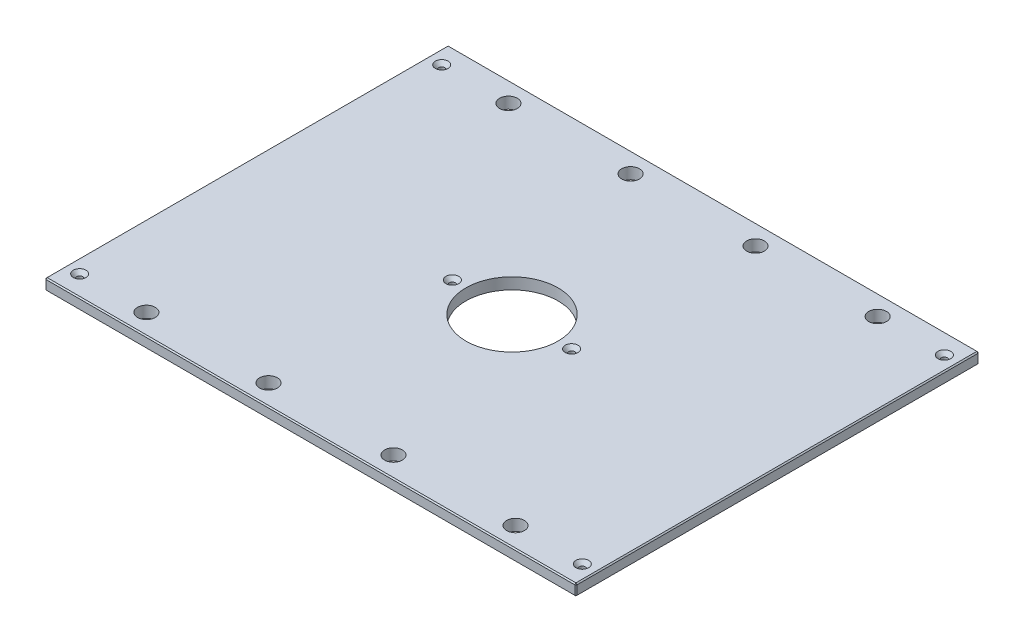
from build123d import *

# Parameters (mm, degrees)
SKETCH1_W                                        = 593.725
SKETCH1_H                                        = 450.85
BOSS_EXTRUDE1_DEPTH                              = 12.7
SKETCH13_R                                       = 51.562
CUT_EXTRUDE6_DEPTH                               = 373.967913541
F_25_32_0_78125_DIAMETER_HOLE1_D                 = 19.84375
CHAMFER2_SIZE                                    = 1.27
CSK_FOR_1_4_FLAT_HEAD_MACHINE_SCREW1_D           = 6.7564
CSK_FOR_1_4_FLAT_HEAD_MACHINE_SCREW1_CSINK_D     = 14.2748
CSK_FOR_1_4_FLAT_HEAD_MACHINE_SCREW1_CSINK_ANGLE = 82


with BuildPart() as part:
    # Sketch1 → Boss-Extrude1 (new body)
    with BuildSketch(Plane(origin=(0, 0, 0), x_dir=(1, 0, 0), z_dir=(0, 1, 0))):
        Rectangle(SKETCH1_W, SKETCH1_H)
    extrude(amount=BOSS_EXTRUDE1_DEPTH)

    # Sketch13 → Cut-Extrude6 (cut, through all)
    with BuildSketch(Plane(origin=(0, 12.7, 0), x_dir=(1, 0, 0), z_dir=(0, 1, 0))):
        with Locations(Location((0, 0, 0), (0, 0, 270))):
            Circle(SKETCH13_R)
    extrude(amount=-CUT_EXTRUDE6_DEPTH, mode=Mode.SUBTRACT)

    # 25_32 _0.78125_ Diameter Hole1 (through all)
    with Locations(Plane(origin=(0, 12.7, 0), x_dir=(1, 0, 0), z_dir=(0, 1, 0))):
        with Locations((206.375, 202.40498), (-206.375, 202.40498), (206.375, -202.40498), (-206.375, -202.40498), (-69.85, 202.40498), (69.85, 202.40498), (69.85, -202.40498), (-69.85, -202.40498)):
            Hole(F_25_32_0_78125_DIAMETER_HOLE1_D / 2)

    # Chamfer2
    chamfer2_edges = [part.edges().sort_by_distance(p)[0] for p in [
        (296.8625, 12.7, 0),
        (0, 12.7, -225.425),
        (-296.8625, 12.7, 0),
        (0, 0, -225.425),
        (296.8625, 0, 0),
        (0, 0, 225.425),
        (-296.8625, 0, 0),
        (0, 12.7, 225.425),
        (-296.8625, 6.35, -225.425),
        (296.8625, 6.35, -225.425),
        (296.8625, 6.35, 225.425),
        (-296.8625, 6.35, 225.425),
    ]]
    chamfer(chamfer2_edges, length=CHAMFER2_SIZE)

    # CSK for 1_4 Flat Head Machine Screw1 (through all)
    with Locations(Plane(origin=(0, 12.7, 0), x_dir=(1, 0, 0), z_dir=(0, 1, 0))):
        with Locations((280.9875, 202.40498), (280.9875, -202.40498), (-280.9875, -202.40498), (-66.675, 0), (66.675, 0), (-280.9875, 202.40498), (-206.375, 202.40498), (-206.375, -202.40498)):
            CounterSinkHole(CSK_FOR_1_4_FLAT_HEAD_MACHINE_SCREW1_D / 2, CSK_FOR_1_4_FLAT_HEAD_MACHINE_SCREW1_CSINK_D / 2, counter_sink_angle=CSK_FOR_1_4_FLAT_HEAD_MACHINE_SCREW1_CSINK_ANGLE)


solid = part.part
